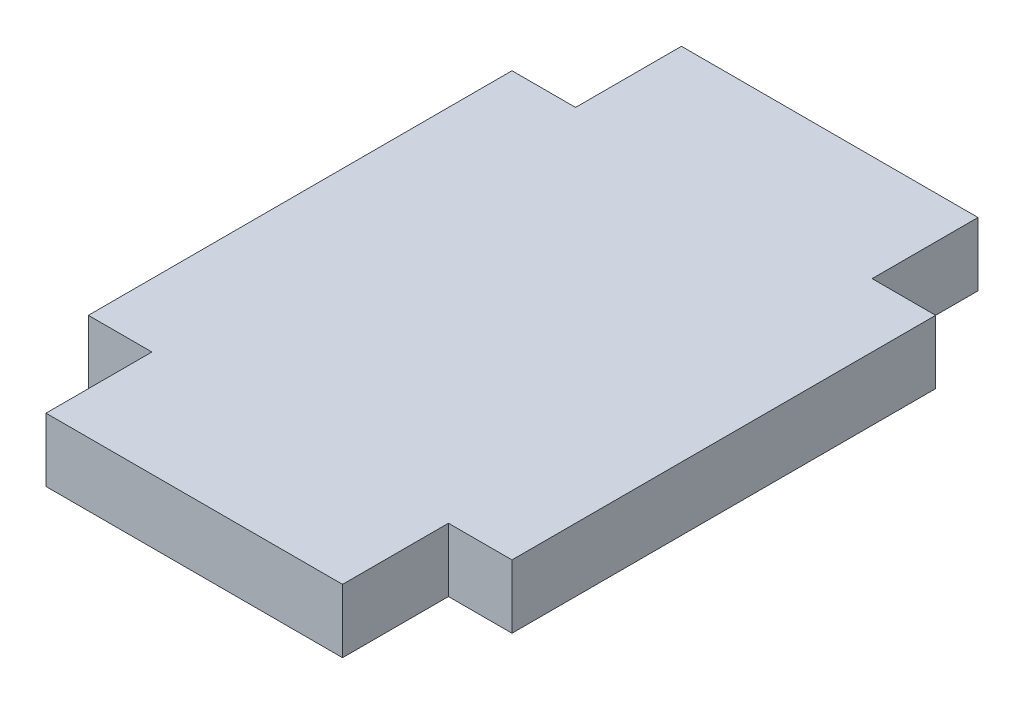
from build123d import *

# Parameters (mm, degrees)
Y_KSEKLIK_EKSTR_ZYON1_DEPTH = 6


with BuildPart() as part:
    # izim1 → Y_kseklik-Ekstr_zyon1 (new body)
    with BuildSketch(Plane(origin=(0, 0, 0), x_dir=(1, 0, 0), z_dir=(0, 1, 0))):
        Polygon((-14, -20), (-20, -20), (-20, 20), (-14, 20), (-14, 30), (14, 30), (14, 20), (20, 20), (20, -20), (14, -20), (14, -30), (-14, -30), align=None)
    extrude(amount=Y_KSEKLIK_EKSTR_ZYON1_DEPTH)


solid = part.part
